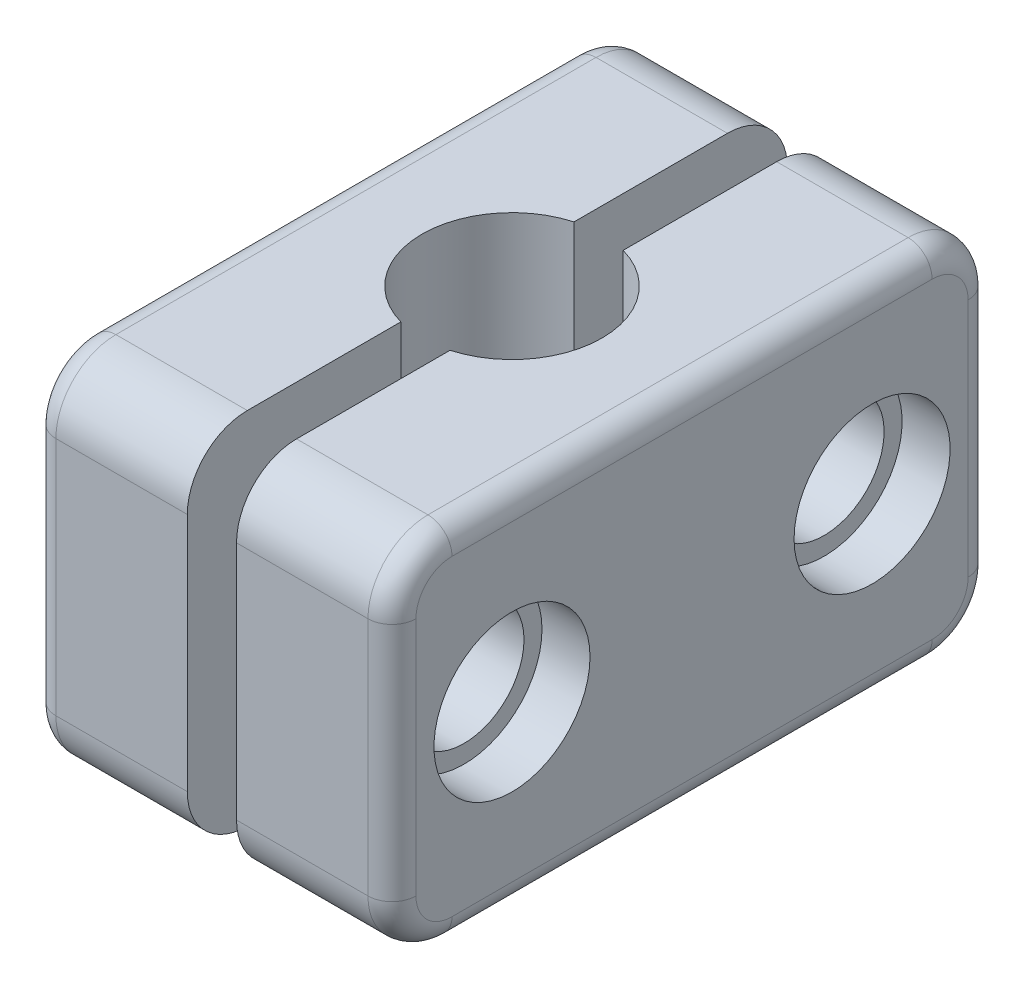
ISO-10303-21;
HEADER;
FILE_DESCRIPTION(('STEP AP214'),'2;1');
FILE_NAME('part.step','',(''),(''),'','','');
FILE_SCHEMA(('AUTOMOTIVE_DESIGN { 1 0 10303 214 1 1 1 1 }'));
ENDSEC;
DATA;
#1=APPLICATION_CONTEXT('core data for automotive mechanical design processes');
#2=APPLICATION_PROTOCOL_DEFINITION('international standard','automotive_design',2000,#1);
#3=PRODUCT_CONTEXT('',#1,'mechanical');
#4=PRODUCT('Part','Part','',(#3));
#5=PRODUCT_RELATED_PRODUCT_CATEGORY('part','',(#4));
#6=PRODUCT_DEFINITION_FORMATION('','',#4);
#7=PRODUCT_DEFINITION_CONTEXT('part definition',#1,'design');
#8=PRODUCT_DEFINITION('design','',#6,#7);
#9=PRODUCT_DEFINITION_SHAPE('','',#8);
#10=(LENGTH_UNIT() NAMED_UNIT(*) SI_UNIT(.MILLI.,.METRE.));
#11=(NAMED_UNIT(*) PLANE_ANGLE_UNIT() SI_UNIT($,.RADIAN.));
#12=(NAMED_UNIT(*) SI_UNIT($,.STERADIAN.) SOLID_ANGLE_UNIT());
#13=UNCERTAINTY_MEASURE_WITH_UNIT(LENGTH_MEASURE(1.E-05),#10,'distance_accuracy_value','');
#14=(GEOMETRIC_REPRESENTATION_CONTEXT(3) GLOBAL_UNCERTAINTY_ASSIGNED_CONTEXT((#13)) GLOBAL_UNIT_ASSIGNED_CONTEXT((#10,
#11,#12)) REPRESENTATION_CONTEXT('',''));
#15=CARTESIAN_POINT('',(0.,0.,0.));
#16=DIRECTION('',(0.,0.,1.));
#17=DIRECTION('',(1.,0.,0.));
#18=AXIS2_PLACEMENT_3D('',#15,#16,#17);
#19=CARTESIAN_POINT('',(-11.,0.,15.));
#20=DIRECTION('',(-1.,0.,0.));
#21=DIRECTION('',(0.,0.,-1.));
#22=AXIS2_PLACEMENT_3D('',#19,#20,#21);
#23=CYLINDRICAL_SURFACE('',#22,6.5);
#24=CARTESIAN_POINT('',(-11.,0.,15.));
#25=DIRECTION('',(-1.,0.,0.));
#26=DIRECTION('',(0.,0.,-1.));
#27=AXIS2_PLACEMENT_3D('',#24,#25,#26);
#28=CIRCLE('',#27,6.5);
#29=CARTESIAN_POINT('',(-11.,0.,8.5));
#30=VERTEX_POINT('',#29);
#31=EDGE_CURVE('E201',#30,#30,#28,.T.);
#32=ORIENTED_EDGE('',*,*,#31,.F.);
#33=EDGE_LOOP('',(#32));
#34=FACE_BOUND('',#33,.T.);
#35=CARTESIAN_POINT('',(-15.,0.,15.));
#36=DIRECTION('',(-1.,0.,0.));
#37=DIRECTION('',(0.,0.,-1.));
#38=AXIS2_PLACEMENT_3D('',#35,#36,#37);
#39=CIRCLE('',#38,6.5);
#40=CARTESIAN_POINT('',(-15.,0.,8.5));
#41=VERTEX_POINT('',#40);
#42=EDGE_CURVE('E193',#41,#41,#39,.T.);
#43=ORIENTED_EDGE('',*,*,#42,.T.);
#44=EDGE_LOOP('',(#43));
#45=FACE_BOUND('',#44,.T.);
#46=ADVANCED_FACE('F47',(#34,#45),#23,.F.);
#47=CARTESIAN_POINT('',(-11.,0.,15.));
#48=DIRECTION('',(1.,0.,0.));
#49=DIRECTION('',(0.,0.,-1.));
#50=AXIS2_PLACEMENT_3D('',#47,#48,#49);
#51=PLANE('',#50);
#52=CARTESIAN_POINT('',(-11.,0.,15.));
#53=DIRECTION('',(-1.,0.,0.));
#54=DIRECTION('',(0.,0.,1.));
#55=AXIS2_PLACEMENT_3D('',#52,#53,#54);
#56=CIRCLE('',#55,5.);
#57=CARTESIAN_POINT('',(-11.,0.,20.));
#58=VERTEX_POINT('',#57);
#59=EDGE_CURVE('E197',#58,#58,#56,.T.);
#60=ORIENTED_EDGE('',*,*,#59,.F.);
#61=EDGE_LOOP('',(#60));
#62=FACE_BOUND('',#61,.T.);
#63=ORIENTED_EDGE('',*,*,#31,.T.);
#64=EDGE_LOOP('',(#63));
#65=FACE_BOUND('',#64,.T.);
#66=ADVANCED_FACE('F358',(#62,#65),#51,.F.);
#67=CARTESIAN_POINT('',(15.,0.,15.));
#68=DIRECTION('',(-1.,0.,0.));
#69=DIRECTION('',(0.,0.,-1.));
#70=AXIS2_PLACEMENT_3D('',#67,#68,#69);
#71=CYLINDRICAL_SURFACE('',#70,5.);
#72=CARTESIAN_POINT('',(-2.05,0.,15.));
#73=DIRECTION('',(1.,0.,0.));
#74=DIRECTION('',(0.,0.,-1.));
#75=AXIS2_PLACEMENT_3D('',#72,#73,#74);
#76=CIRCLE('',#75,5.);
#77=CARTESIAN_POINT('',(-2.05,0.,10.));
#78=VERTEX_POINT('',#77);
#79=EDGE_CURVE('E173',#78,#78,#76,.T.);
#80=ORIENTED_EDGE('',*,*,#79,.T.);
#81=EDGE_LOOP('',(#80));
#82=FACE_BOUND('',#81,.T.);
#83=ORIENTED_EDGE('',*,*,#59,.T.);
#84=EDGE_LOOP('',(#83));
#85=FACE_BOUND('',#84,.T.);
#86=ADVANCED_FACE('F364',(#82,#85),#71,.F.);
#87=CARTESIAN_POINT('',(-15.,10.,20.));
#88=DIRECTION('',(-1.,0.,0.));
#89=DIRECTION('',(0.,0.,-1.));
#90=AXIS2_PLACEMENT_3D('',#87,#88,#89);
#91=PLANE('',#90);
#92=CARTESIAN_POINT('',(-15.,0.,-15.));
#93=DIRECTION('',(-1.,0.,0.));
#94=DIRECTION('',(0.,0.,1.));
#95=AXIS2_PLACEMENT_3D('',#92,#93,#94);
#96=CIRCLE('',#95,6.5);
#97=CARTESIAN_POINT('',(-15.,0.,-8.5));
#98=VERTEX_POINT('',#97);
#99=EDGE_CURVE('E198',#98,#98,#96,.T.);
#100=ORIENTED_EDGE('',*,*,#99,.F.);
#101=EDGE_LOOP('',(#100));
#102=FACE_BOUND('',#101,.T.);
#103=ORIENTED_EDGE('',*,*,#42,.F.);
#104=EDGE_LOOP('',(#103));
#105=FACE_BOUND('',#104,.T.);
#106=DIRECTION('',(0.,0.,-1.));
#107=VECTOR('',#106,1.);
#108=CARTESIAN_POINT('',(-15.,13.,20.));
#109=LINE('',#108,#107);
#110=CARTESIAN_POINT('',(-15.,13.,-20.));
#111=VERTEX_POINT('',#110);
#112=CARTESIAN_POINT('',(-15.,13.,20.));
#113=VERTEX_POINT('',#112);
#114=EDGE_CURVE('E224',#111,#113,#109,.F.);
#115=ORIENTED_EDGE('',*,*,#114,.F.);
#116=CARTESIAN_POINT('',(-15.,10.,-20.));
#117=DIRECTION('',(1.,0.,0.));
#118=DIRECTION('',(0.,0.,-1.));
#119=AXIS2_PLACEMENT_3D('',#116,#117,#118);
#120=CIRCLE('',#119,3.);
#121=CARTESIAN_POINT('',(-15.,9.99999999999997,-23.));
#122=VERTEX_POINT('',#121);
#123=EDGE_CURVE('E227',#122,#111,#120,.T.);
#124=ORIENTED_EDGE('',*,*,#123,.F.);
#125=DIRECTION('',(0.,-1.,0.));
#126=VECTOR('',#125,1.);
#127=CARTESIAN_POINT('',(-15.,9.99999999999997,-23.));
#128=LINE('',#127,#126);
#129=CARTESIAN_POINT('',(-15.,-9.99999999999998,-23.));
#130=VERTEX_POINT('',#129);
#131=EDGE_CURVE('E230',#130,#122,#128,.F.);
#132=ORIENTED_EDGE('',*,*,#131,.F.);
#133=CARTESIAN_POINT('',(-15.,-10.,-20.));
#134=DIRECTION('',(1.,0.,0.));
#135=DIRECTION('',(0.,0.,-1.));
#136=AXIS2_PLACEMENT_3D('',#133,#134,#135);
#137=CIRCLE('',#136,3.);
#138=CARTESIAN_POINT('',(-15.,-13.,-20.));
#139=VERTEX_POINT('',#138);
#140=EDGE_CURVE('E233',#139,#130,#137,.T.);
#141=ORIENTED_EDGE('',*,*,#140,.F.);
#142=DIRECTION('',(0.,0.,1.));
#143=VECTOR('',#142,1.);
#144=CARTESIAN_POINT('',(-15.,-13.,-20.));
#145=LINE('',#144,#143);
#146=CARTESIAN_POINT('',(-15.,-13.,20.));
#147=VERTEX_POINT('',#146);
#148=EDGE_CURVE('E236',#147,#139,#145,.F.);
#149=ORIENTED_EDGE('',*,*,#148,.F.);
#150=CARTESIAN_POINT('',(-15.,-10.,20.));
#151=DIRECTION('',(1.,0.,0.));
#152=DIRECTION('',(0.,0.,-1.));
#153=AXIS2_PLACEMENT_3D('',#150,#151,#152);
#154=CIRCLE('',#153,3.);
#155=CARTESIAN_POINT('',(-15.,-10.,23.));
#156=VERTEX_POINT('',#155);
#157=EDGE_CURVE('E239',#156,#147,#154,.T.);
#158=ORIENTED_EDGE('',*,*,#157,.F.);
#159=DIRECTION('',(0.,1.,0.));
#160=VECTOR('',#159,1.);
#161=CARTESIAN_POINT('',(-15.,-10.,23.));
#162=LINE('',#161,#160);
#163=CARTESIAN_POINT('',(-15.,9.99999999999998,23.));
#164=VERTEX_POINT('',#163);
#165=EDGE_CURVE('E242',#164,#156,#162,.F.);
#166=ORIENTED_EDGE('',*,*,#165,.F.);
#167=CARTESIAN_POINT('',(-15.,10.,20.));
#168=DIRECTION('',(1.,0.,0.));
#169=DIRECTION('',(0.,0.,-1.));
#170=AXIS2_PLACEMENT_3D('',#167,#168,#169);
#171=CIRCLE('',#170,3.);
#172=EDGE_CURVE('E245',#113,#164,#171,.T.);
#173=ORIENTED_EDGE('',*,*,#172,.F.);
#174=EDGE_LOOP('',(#115,#124,#132,#141,#149,#158,#166,#173));
#175=FACE_BOUND('',#174,.T.);
#176=ADVANCED_FACE('F315',(#102,#105,#175),#91,.T.);
#177=CARTESIAN_POINT('',(-13.,10.,20.));
#178=DIRECTION('',(-1.,0.,0.));
#179=DIRECTION('',(0.,0.,-1.));
#180=AXIS2_PLACEMENT_3D('',#177,#178,#179);
#181=TOROIDAL_SURFACE('',#180,3.,2.);
#182=CARTESIAN_POINT('',(-13.,9.99999999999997,23.));
#183=DIRECTION('',(0.,-1.,0.));
#184=DIRECTION('',(-1.,0.,0.));
#185=AXIS2_PLACEMENT_3D('',#182,#183,#184);
#186=CIRCLE('',#185,2.);
#187=CARTESIAN_POINT('',(-13.,9.99999999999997,25.));
#188=VERTEX_POINT('',#187);
#189=EDGE_CURVE('E272',#188,#164,#186,.T.);
#190=ORIENTED_EDGE('',*,*,#189,.F.);
#191=CARTESIAN_POINT('',(-13.,10.,20.));
#192=DIRECTION('',(1.,0.,0.));
#193=DIRECTION('',(0.,0.,-1.));
#194=AXIS2_PLACEMENT_3D('',#191,#192,#193);
#195=CIRCLE('',#194,5.);
#196=CARTESIAN_POINT('',(-13.,15.,20.));
#197=VERTEX_POINT('',#196);
#198=EDGE_CURVE('E221',#188,#197,#195,.F.);
#199=ORIENTED_EDGE('',*,*,#198,.T.);
#200=CARTESIAN_POINT('',(-13.,13.,20.));
#201=DIRECTION('',(0.,0.,-1.));
#202=DIRECTION('',(0.,1.,0.));
#203=AXIS2_PLACEMENT_3D('',#200,#201,#202);
#204=CIRCLE('',#203,2.);
#205=EDGE_CURVE('E269',#113,#197,#204,.T.);
#206=ORIENTED_EDGE('',*,*,#205,.F.);
#207=ORIENTED_EDGE('',*,*,#172,.T.);
#208=EDGE_LOOP('',(#190,#199,#206,#207));
#209=FACE_BOUND('',#208,.T.);
#210=ADVANCED_FACE('F320',(#209),#181,.T.);
#211=CARTESIAN_POINT('',(-13.,13.,-20.));
#212=DIRECTION('',(0.,0.,1.));
#213=DIRECTION('',(-1.,0.,0.));
#214=AXIS2_PLACEMENT_3D('',#211,#212,#213);
#215=CYLINDRICAL_SURFACE('',#214,2.);
#216=CARTESIAN_POINT('',(-13.,13.,-20.));
#217=DIRECTION('',(0.,0.,-1.));
#218=DIRECTION('',(0.,1.,0.));
#219=AXIS2_PLACEMENT_3D('',#216,#217,#218);
#220=CIRCLE('',#219,2.);
#221=CARTESIAN_POINT('',(-13.,15.,-20.));
#222=VERTEX_POINT('',#221);
#223=EDGE_CURVE('E275',#111,#222,#220,.T.);
#224=ORIENTED_EDGE('',*,*,#223,.F.);
#225=ORIENTED_EDGE('',*,*,#114,.T.);
#226=ORIENTED_EDGE('',*,*,#205,.T.);
#227=DIRECTION('',(0.,0.,-1.));
#228=VECTOR('',#227,1.);
#229=CARTESIAN_POINT('',(-13.,15.,-20.));
#230=LINE('',#229,#228);
#231=EDGE_CURVE('E266',#197,#222,#230,.T.);
#232=ORIENTED_EDGE('',*,*,#231,.T.);
#233=EDGE_LOOP('',(#224,#225,#226,#232));
#234=FACE_BOUND('',#233,.T.);
#235=ADVANCED_FACE('F308',(#234),#215,.T.);
#236=CARTESIAN_POINT('',(-13.,10.,-20.));
#237=DIRECTION('',(-1.,0.,0.));
#238=DIRECTION('',(0.,0.,-1.));
#239=AXIS2_PLACEMENT_3D('',#236,#237,#238);
#240=TOROIDAL_SURFACE('',#239,3.,2.);
#241=CARTESIAN_POINT('',(-13.,9.99999999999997,-23.));
#242=DIRECTION('',(0.,-1.,0.));
#243=DIRECTION('',(0.,0.,-1.));
#244=AXIS2_PLACEMENT_3D('',#241,#242,#243);
#245=CIRCLE('',#244,2.);
#246=CARTESIAN_POINT('',(-13.,9.99999999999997,-25.));
#247=VERTEX_POINT('',#246);
#248=EDGE_CURVE('E280',#122,#247,#245,.T.);
#249=ORIENTED_EDGE('',*,*,#248,.F.);
#250=ORIENTED_EDGE('',*,*,#123,.T.);
#251=ORIENTED_EDGE('',*,*,#223,.T.);
#252=CARTESIAN_POINT('',(-13.,10.,-20.));
#253=DIRECTION('',(1.,0.,0.));
#254=DIRECTION('',(0.,0.,-1.));
#255=AXIS2_PLACEMENT_3D('',#252,#253,#254);
#256=CIRCLE('',#255,5.);
#257=EDGE_CURVE('E263',#222,#247,#256,.F.);
#258=ORIENTED_EDGE('',*,*,#257,.T.);
#259=EDGE_LOOP('',(#249,#250,#251,#258));
#260=FACE_BOUND('',#259,.T.);
#261=ADVANCED_FACE('F309',(#260),#240,.T.);
#262=CARTESIAN_POINT('',(-13.,9.99999999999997,-23.));
#263=DIRECTION('',(0.,1.,0.));
#264=DIRECTION('',(0.,0.,-1.));
#265=AXIS2_PLACEMENT_3D('',#262,#263,#264);
#266=CYLINDRICAL_SURFACE('',#265,2.);
#267=CARTESIAN_POINT('',(-13.,-9.99999999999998,-23.));
#268=DIRECTION('',(0.,-1.,0.));
#269=DIRECTION('',(0.,0.,-1.));
#270=AXIS2_PLACEMENT_3D('',#267,#268,#269);
#271=CIRCLE('',#270,2.);
#272=CARTESIAN_POINT('',(-13.,-9.99999999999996,-25.));
#273=VERTEX_POINT('',#272);
#274=EDGE_CURVE('E285',#130,#273,#271,.T.);
#275=ORIENTED_EDGE('',*,*,#274,.F.);
#276=ORIENTED_EDGE('',*,*,#131,.T.);
#277=ORIENTED_EDGE('',*,*,#248,.T.);
#278=DIRECTION('',(0.,-1.,0.));
#279=VECTOR('',#278,1.);
#280=CARTESIAN_POINT('',(-13.,-9.99999999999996,-25.));
#281=LINE('',#280,#279);
#282=EDGE_CURVE('E260',#247,#273,#281,.T.);
#283=ORIENTED_EDGE('',*,*,#282,.T.);
#284=EDGE_LOOP('',(#275,#276,#277,#283));
#285=FACE_BOUND('',#284,.T.);
#286=ADVANCED_FACE('F346',(#285),#266,.T.);
#287=CARTESIAN_POINT('',(-13.,-10.,-20.));
#288=DIRECTION('',(-1.,0.,0.));
#289=DIRECTION('',(0.,0.,-1.));
#290=AXIS2_PLACEMENT_3D('',#287,#288,#289);
#291=TOROIDAL_SURFACE('',#290,3.,2.);
#292=ORIENTED_EDGE('',*,*,#274,.T.);
#293=CARTESIAN_POINT('',(-13.,-10.,-20.));
#294=DIRECTION('',(1.,0.,0.));
#295=DIRECTION('',(0.,0.,-1.));
#296=AXIS2_PLACEMENT_3D('',#293,#294,#295);
#297=CIRCLE('',#296,5.);
#298=CARTESIAN_POINT('',(-13.,-15.,-20.));
#299=VERTEX_POINT('',#298);
#300=EDGE_CURVE('E257',#273,#299,#297,.F.);
#301=ORIENTED_EDGE('',*,*,#300,.T.);
#302=CARTESIAN_POINT('',(-13.,-13.,-20.));
#303=DIRECTION('',(0.,0.,-1.));
#304=DIRECTION('',(0.,1.,0.));
#305=AXIS2_PLACEMENT_3D('',#302,#303,#304);
#306=CIRCLE('',#305,2.);
#307=EDGE_CURVE('E209',#299,#139,#306,.T.);
#308=ORIENTED_EDGE('',*,*,#307,.T.);
#309=ORIENTED_EDGE('',*,*,#140,.T.);
#310=EDGE_LOOP('',(#292,#301,#308,#309));
#311=FACE_BOUND('',#310,.T.);
#312=ADVANCED_FACE('F49',(#311),#291,.T.);
#313=CARTESIAN_POINT('',(-13.,-13.,-20.));
#314=DIRECTION('',(0.,0.,-1.));
#315=DIRECTION('',(1.,0.,0.));
#316=AXIS2_PLACEMENT_3D('',#313,#314,#315);
#317=CYLINDRICAL_SURFACE('',#316,2.);
#318=ORIENTED_EDGE('',*,*,#307,.F.);
#319=DIRECTION('',(0.,0.,1.));
#320=VECTOR('',#319,1.);
#321=CARTESIAN_POINT('',(-13.,-15.,20.));
#322=LINE('',#321,#320);
#323=CARTESIAN_POINT('',(-13.,-15.,20.));
#324=VERTEX_POINT('',#323);
#325=EDGE_CURVE('E254',#299,#324,#322,.T.);
#326=ORIENTED_EDGE('',*,*,#325,.T.);
#327=CARTESIAN_POINT('',(-13.,-13.,20.));
#328=DIRECTION('',(0.,0.,-1.));
#329=DIRECTION('',(-1.,0.,0.));
#330=AXIS2_PLACEMENT_3D('',#327,#328,#329);
#331=CIRCLE('',#330,2.);
#332=EDGE_CURVE('E283',#324,#147,#331,.T.);
#333=ORIENTED_EDGE('',*,*,#332,.T.);
#334=ORIENTED_EDGE('',*,*,#148,.T.);
#335=EDGE_LOOP('',(#318,#326,#333,#334));
#336=FACE_BOUND('',#335,.T.);
#337=ADVANCED_FACE('F339',(#336),#317,.T.);
#338=CARTESIAN_POINT('',(-13.,-10.,20.));
#339=DIRECTION('',(-1.,0.,0.));
#340=DIRECTION('',(0.,0.,-1.));
#341=AXIS2_PLACEMENT_3D('',#338,#339,#340);
#342=TOROIDAL_SURFACE('',#341,3.,2.);
#343=ORIENTED_EDGE('',*,*,#332,.F.);
#344=CARTESIAN_POINT('',(-13.,-10.,20.));
#345=DIRECTION('',(1.,0.,0.));
#346=DIRECTION('',(0.,0.,-1.));
#347=AXIS2_PLACEMENT_3D('',#344,#345,#346);
#348=CIRCLE('',#347,5.);
#349=CARTESIAN_POINT('',(-13.,-10.,25.));
#350=VERTEX_POINT('',#349);
#351=EDGE_CURVE('E251',#324,#350,#348,.F.);
#352=ORIENTED_EDGE('',*,*,#351,.T.);
#353=CARTESIAN_POINT('',(-13.,-10.,23.));
#354=DIRECTION('',(0.,-1.,0.));
#355=DIRECTION('',(0.,0.,-1.));
#356=AXIS2_PLACEMENT_3D('',#353,#354,#355);
#357=CIRCLE('',#356,2.);
#358=EDGE_CURVE('E278',#350,#156,#357,.T.);
#359=ORIENTED_EDGE('',*,*,#358,.T.);
#360=ORIENTED_EDGE('',*,*,#157,.T.);
#361=EDGE_LOOP('',(#343,#352,#359,#360));
#362=FACE_BOUND('',#361,.T.);
#363=ADVANCED_FACE('F335',(#362),#342,.T.);
#364=CARTESIAN_POINT('',(-13.,9.99999999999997,23.));
#365=DIRECTION('',(0.,-1.,0.));
#366=DIRECTION('',(0.,0.,1.));
#367=AXIS2_PLACEMENT_3D('',#364,#365,#366);
#368=CYLINDRICAL_SURFACE('',#367,2.);
#369=ORIENTED_EDGE('',*,*,#358,.F.);
#370=DIRECTION('',(0.,1.,0.));
#371=VECTOR('',#370,1.);
#372=CARTESIAN_POINT('',(-13.,9.99999999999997,25.));
#373=LINE('',#372,#371);
#374=EDGE_CURVE('E248',#350,#188,#373,.T.);
#375=ORIENTED_EDGE('',*,*,#374,.T.);
#376=ORIENTED_EDGE('',*,*,#189,.T.);
#377=ORIENTED_EDGE('',*,*,#165,.T.);
#378=EDGE_LOOP('',(#369,#375,#376,#377));
#379=FACE_BOUND('',#378,.T.);
#380=ADVANCED_FACE('F384',(#379),#368,.T.);
#381=CARTESIAN_POINT('',(15.,9.99999999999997,25.));
#382=DIRECTION('',(0.,0.,-1.));
#383=DIRECTION('',(0.,-1.,0.));
#384=AXIS2_PLACEMENT_3D('',#381,#382,#383);
#385=PLANE('',#384);
#386=DIRECTION('',(-1.,0.,0.));
#387=VECTOR('',#386,1.);
#388=CARTESIAN_POINT('',(15.,9.99999999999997,25.));
#389=LINE('',#388,#387);
#390=CARTESIAN_POINT('',(-2.05,9.99999999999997,25.));
#391=VERTEX_POINT('',#390);
#392=EDGE_CURVE('E206',#391,#188,#389,.T.);
#393=ORIENTED_EDGE('',*,*,#392,.T.);
#394=ORIENTED_EDGE('',*,*,#374,.F.);
#395=DIRECTION('',(-1.,0.,0.));
#396=VECTOR('',#395,1.);
#397=CARTESIAN_POINT('',(15.,-10.,25.));
#398=LINE('',#397,#396);
#399=CARTESIAN_POINT('',(-2.05,-10.,25.));
#400=VERTEX_POINT('',#399);
#401=EDGE_CURVE('E208',#400,#350,#398,.T.);
#402=ORIENTED_EDGE('',*,*,#401,.F.);
#403=DIRECTION('',(0.,-1.,0.));
#404=VECTOR('',#403,1.);
#405=CARTESIAN_POINT('',(-2.05,9.99999999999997,25.));
#406=LINE('',#405,#404);
#407=EDGE_CURVE('E175',#391,#400,#406,.T.);
#408=ORIENTED_EDGE('',*,*,#407,.F.);
#409=EDGE_LOOP('',(#393,#394,#402,#408));
#410=FACE_BOUND('',#409,.T.);
#411=ADVANCED_FACE('F328',(#410),#385,.F.);
#412=CARTESIAN_POINT('',(15.,-10.,20.));
#413=DIRECTION('',(-1.,0.,0.));
#414=DIRECTION('',(0.,0.,-1.));
#415=AXIS2_PLACEMENT_3D('',#412,#413,#414);
#416=CYLINDRICAL_SURFACE('',#415,5.);
#417=ORIENTED_EDGE('',*,*,#401,.T.);
#418=ORIENTED_EDGE('',*,*,#351,.F.);
#419=DIRECTION('',(-1.,0.,0.));
#420=VECTOR('',#419,1.);
#421=CARTESIAN_POINT('',(15.,-15.,20.));
#422=LINE('',#421,#420);
#423=CARTESIAN_POINT('',(-2.05,-15.,20.));
#424=VERTEX_POINT('',#423);
#425=EDGE_CURVE('E211',#424,#324,#422,.T.);
#426=ORIENTED_EDGE('',*,*,#425,.F.);
#427=CARTESIAN_POINT('',(-2.05,-10.,20.));
#428=DIRECTION('',(1.,0.,0.));
#429=DIRECTION('',(0.,0.,-1.));
#430=AXIS2_PLACEMENT_3D('',#427,#428,#429);
#431=CIRCLE('',#430,5.);
#432=EDGE_CURVE('E62',#400,#424,#431,.T.);
#433=ORIENTED_EDGE('',*,*,#432,.F.);
#434=EDGE_LOOP('',(#417,#418,#426,#433));
#435=FACE_BOUND('',#434,.T.);
#436=ADVANCED_FACE('F332',(#435),#416,.T.);
#437=CARTESIAN_POINT('',(15.,-15.,-20.));
#438=DIRECTION('',(0.,1.,0.));
#439=DIRECTION('',(0.,0.,-1.));
#440=AXIS2_PLACEMENT_3D('',#437,#438,#439);
#441=PLANE('',#440);
#442=CARTESIAN_POINT('',(0.,-15.,0.));
#443=DIRECTION('',(0.,-1.,0.));
#444=DIRECTION('',(0.,0.,-1.));
#445=AXIS2_PLACEMENT_3D('',#442,#443,#444);
#446=CIRCLE('',#445,7.5);
#447=CARTESIAN_POINT('',(-2.05,-15.,7.21439533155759));
#448=VERTEX_POINT('',#447);
#449=CARTESIAN_POINT('',(-2.05,-15.,-7.21439533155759));
#450=VERTEX_POINT('',#449);
#451=EDGE_CURVE('E55',#448,#450,#446,.T.);
#452=ORIENTED_EDGE('',*,*,#451,.F.);
#453=DIRECTION('',(0.,0.,-1.));
#454=VECTOR('',#453,1.);
#455=CARTESIAN_POINT('',(-2.04999999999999,-15.,-20.));
#456=LINE('',#455,#454);
#457=EDGE_CURVE('E156',#424,#448,#456,.T.);
#458=ORIENTED_EDGE('',*,*,#457,.F.);
#459=ORIENTED_EDGE('',*,*,#425,.T.);
#460=ORIENTED_EDGE('',*,*,#325,.F.);
#461=DIRECTION('',(-1.,0.,0.));
#462=VECTOR('',#461,1.);
#463=CARTESIAN_POINT('',(15.,-15.,-20.));
#464=LINE('',#463,#462);
#465=CARTESIAN_POINT('',(-2.05,-15.,-20.));
#466=VERTEX_POINT('',#465);
#467=EDGE_CURVE('E213',#466,#299,#464,.T.);
#468=ORIENTED_EDGE('',*,*,#467,.F.);
#469=DIRECTION('',(0.,0.,-1.));
#470=VECTOR('',#469,1.);
#471=CARTESIAN_POINT('',(-2.05,-15.,-20.));
#472=LINE('',#471,#470);
#473=EDGE_CURVE('E12',#450,#466,#472,.T.);
#474=ORIENTED_EDGE('',*,*,#473,.F.);
#475=EDGE_LOOP('',(#452,#458,#459,#460,#468,#474));
#476=FACE_BOUND('',#475,.T.);
#477=ADVANCED_FACE('F296',(#476),#441,.F.);
#478=CARTESIAN_POINT('',(15.,-10.,-20.));
#479=DIRECTION('',(-1.,0.,0.));
#480=DIRECTION('',(0.,0.,-1.));
#481=AXIS2_PLACEMENT_3D('',#478,#479,#480);
#482=CYLINDRICAL_SURFACE('',#481,5.);
#483=ORIENTED_EDGE('',*,*,#467,.T.);
#484=ORIENTED_EDGE('',*,*,#300,.F.);
#485=DIRECTION('',(-1.,0.,0.));
#486=VECTOR('',#485,1.);
#487=CARTESIAN_POINT('',(15.,-9.99999999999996,-25.));
#488=LINE('',#487,#486);
#489=CARTESIAN_POINT('',(-2.05,-10.,-25.));
#490=VERTEX_POINT('',#489);
#491=EDGE_CURVE('E215',#490,#273,#488,.T.);
#492=ORIENTED_EDGE('',*,*,#491,.F.);
#493=CARTESIAN_POINT('',(-2.05,-10.,-20.));
#494=DIRECTION('',(1.,0.,0.));
#495=DIRECTION('',(0.,0.,-1.));
#496=AXIS2_PLACEMENT_3D('',#493,#494,#495);
#497=CIRCLE('',#496,5.);
#498=EDGE_CURVE('E181',#466,#490,#497,.T.);
#499=ORIENTED_EDGE('',*,*,#498,.F.);
#500=EDGE_LOOP('',(#483,#484,#492,#499));
#501=FACE_BOUND('',#500,.T.);
#502=ADVANCED_FACE('F344',(#501),#482,.T.);
#503=CARTESIAN_POINT('',(15.,9.99999999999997,-25.));
#504=DIRECTION('',(0.,0.,1.));
#505=DIRECTION('',(0.,1.,0.));
#506=AXIS2_PLACEMENT_3D('',#503,#504,#505);
#507=PLANE('',#506);
#508=ORIENTED_EDGE('',*,*,#491,.T.);
#509=ORIENTED_EDGE('',*,*,#282,.F.);
#510=DIRECTION('',(-1.,0.,0.));
#511=VECTOR('',#510,1.);
#512=CARTESIAN_POINT('',(15.,9.99999999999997,-25.));
#513=LINE('',#512,#511);
#514=CARTESIAN_POINT('',(-2.05,9.99999999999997,-25.));
#515=VERTEX_POINT('',#514);
#516=EDGE_CURVE('E217',#515,#247,#513,.T.);
#517=ORIENTED_EDGE('',*,*,#516,.F.);
#518=DIRECTION('',(0.,1.,0.));
#519=VECTOR('',#518,1.);
#520=CARTESIAN_POINT('',(-2.05,9.99999999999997,-25.));
#521=LINE('',#520,#519);
#522=EDGE_CURVE('E184',#490,#515,#521,.T.);
#523=ORIENTED_EDGE('',*,*,#522,.F.);
#524=EDGE_LOOP('',(#508,#509,#517,#523));
#525=FACE_BOUND('',#524,.T.);
#526=ADVANCED_FACE('F348',(#525),#507,.F.);
#527=CARTESIAN_POINT('',(15.,10.,-20.));
#528=DIRECTION('',(-1.,0.,0.));
#529=DIRECTION('',(0.,0.,-1.));
#530=AXIS2_PLACEMENT_3D('',#527,#528,#529);
#531=CYLINDRICAL_SURFACE('',#530,5.);
#532=ORIENTED_EDGE('',*,*,#516,.T.);
#533=ORIENTED_EDGE('',*,*,#257,.F.);
#534=DIRECTION('',(-1.,0.,0.));
#535=VECTOR('',#534,1.);
#536=CARTESIAN_POINT('',(15.,15.,-20.));
#537=LINE('',#536,#535);
#538=CARTESIAN_POINT('',(-2.05,15.,-20.));
#539=VERTEX_POINT('',#538);
#540=EDGE_CURVE('E70',#539,#222,#537,.T.);
#541=ORIENTED_EDGE('',*,*,#540,.F.);
#542=CARTESIAN_POINT('',(-2.05,10.,-20.));
#543=DIRECTION('',(1.,0.,0.));
#544=DIRECTION('',(0.,0.,-1.));
#545=AXIS2_PLACEMENT_3D('',#542,#543,#544);
#546=CIRCLE('',#545,5.);
#547=EDGE_CURVE('E187',#515,#539,#546,.T.);
#548=ORIENTED_EDGE('',*,*,#547,.F.);
#549=EDGE_LOOP('',(#532,#533,#541,#548));
#550=FACE_BOUND('',#549,.T.);
#551=ADVANCED_FACE('F304',(#550),#531,.T.);
#552=CARTESIAN_POINT('',(15.,15.,-20.));
#553=DIRECTION('',(0.,-1.,0.));
#554=DIRECTION('',(0.,0.,1.));
#555=AXIS2_PLACEMENT_3D('',#552,#553,#554);
#556=PLANE('',#555);
#557=ORIENTED_EDGE('',*,*,#540,.T.);
#558=ORIENTED_EDGE('',*,*,#231,.F.);
#559=DIRECTION('',(-1.,0.,0.));
#560=VECTOR('',#559,1.);
#561=CARTESIAN_POINT('',(15.,15.,20.));
#562=LINE('',#561,#560);
#563=CARTESIAN_POINT('',(-2.05,15.,20.));
#564=VERTEX_POINT('',#563);
#565=EDGE_CURVE('E169',#564,#197,#562,.T.);
#566=ORIENTED_EDGE('',*,*,#565,.F.);
#567=DIRECTION('',(0.,0.,-1.));
#568=VECTOR('',#567,1.);
#569=CARTESIAN_POINT('',(-2.05,15.,38.0518627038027));
#570=LINE('',#569,#568);
#571=CARTESIAN_POINT('',(-2.05,15.,7.21439533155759));
#572=VERTEX_POINT('',#571);
#573=EDGE_CURVE('E154',#564,#572,#570,.T.);
#574=ORIENTED_EDGE('',*,*,#573,.T.);
#575=CARTESIAN_POINT('',(0.,15.,0.));
#576=DIRECTION('',(0.,-1.,0.));
#577=DIRECTION('',(0.,0.,-1.));
#578=AXIS2_PLACEMENT_3D('',#575,#576,#577);
#579=CIRCLE('',#578,7.5);
#580=CARTESIAN_POINT('',(-2.05,15.,-7.21439533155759));
#581=VERTEX_POINT('',#580);
#582=EDGE_CURVE('E164',#572,#581,#579,.T.);
#583=ORIENTED_EDGE('',*,*,#582,.T.);
#584=DIRECTION('',(0.,0.,-1.));
#585=VECTOR('',#584,1.);
#586=CARTESIAN_POINT('',(-2.05,15.,-7.21439533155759));
#587=LINE('',#586,#585);
#588=EDGE_CURVE('E161',#581,#539,#587,.T.);
#589=ORIENTED_EDGE('',*,*,#588,.T.);
#590=EDGE_LOOP('',(#557,#558,#566,#574,#583,#589));
#591=FACE_BOUND('',#590,.T.);
#592=ADVANCED_FACE('F168',(#591),#556,.F.);
#593=CARTESIAN_POINT('',(15.,10.,20.));
#594=DIRECTION('',(-1.,0.,0.));
#595=DIRECTION('',(0.,0.,-1.));
#596=AXIS2_PLACEMENT_3D('',#593,#594,#595);
#597=CYLINDRICAL_SURFACE('',#596,5.);
#598=ORIENTED_EDGE('',*,*,#565,.T.);
#599=ORIENTED_EDGE('',*,*,#198,.F.);
#600=ORIENTED_EDGE('',*,*,#392,.F.);
#601=CARTESIAN_POINT('',(-2.05,10.,20.));
#602=DIRECTION('',(1.,0.,0.));
#603=DIRECTION('',(0.,0.,-1.));
#604=AXIS2_PLACEMENT_3D('',#601,#602,#603);
#605=CIRCLE('',#604,5.);
#606=EDGE_CURVE('E179',#564,#391,#605,.T.);
#607=ORIENTED_EDGE('',*,*,#606,.F.);
#608=EDGE_LOOP('',(#598,#599,#600,#607));
#609=FACE_BOUND('',#608,.T.);
#610=ADVANCED_FACE('F324',(#609),#597,.T.);
#611=CARTESIAN_POINT('',(-11.,0.,-15.));
#612=DIRECTION('',(-1.,0.,0.));
#613=DIRECTION('',(0.,0.,-1.));
#614=AXIS2_PLACEMENT_3D('',#611,#612,#613);
#615=CYLINDRICAL_SURFACE('',#614,6.5);
#616=CARTESIAN_POINT('',(-11.,0.,-15.));
#617=DIRECTION('',(-1.,0.,0.));
#618=DIRECTION('',(0.,0.,1.));
#619=AXIS2_PLACEMENT_3D('',#616,#617,#618);
#620=CIRCLE('',#619,6.5);
#621=CARTESIAN_POINT('',(-11.,0.,-8.5));
#622=VERTEX_POINT('',#621);
#623=EDGE_CURVE('E194',#622,#622,#620,.T.);
#624=ORIENTED_EDGE('',*,*,#623,.F.);
#625=EDGE_LOOP('',(#624));
#626=FACE_BOUND('',#625,.T.);
#627=ORIENTED_EDGE('',*,*,#99,.T.);
#628=EDGE_LOOP('',(#627));
#629=FACE_BOUND('',#628,.T.);
#630=ADVANCED_FACE('F423',(#626,#629),#615,.F.);
#631=CARTESIAN_POINT('',(-11.,0.,-15.));
#632=DIRECTION('',(-1.,0.,0.));
#633=DIRECTION('',(0.,0.,1.));
#634=AXIS2_PLACEMENT_3D('',#631,#632,#633);
#635=PLANE('',#634);
#636=CARTESIAN_POINT('',(-11.,0.,-15.));
#637=DIRECTION('',(1.,0.,0.));
#638=DIRECTION('',(0.,0.,-1.));
#639=AXIS2_PLACEMENT_3D('',#636,#637,#638);
#640=CIRCLE('',#639,5.);
#641=CARTESIAN_POINT('',(-11.,0.,-20.));
#642=VERTEX_POINT('',#641);
#643=EDGE_CURVE('E273',#642,#642,#640,.T.);
#644=ORIENTED_EDGE('',*,*,#643,.T.);
#645=EDGE_LOOP('',(#644));
#646=FACE_BOUND('',#645,.T.);
#647=ORIENTED_EDGE('',*,*,#623,.T.);
#648=EDGE_LOOP('',(#647));
#649=FACE_BOUND('',#648,.T.);
#650=ADVANCED_FACE('F377',(#646,#649),#635,.T.);
#651=CARTESIAN_POINT('',(15.,0.,-15.));
#652=DIRECTION('',(-1.,0.,0.));
#653=DIRECTION('',(0.,0.,-1.));
#654=AXIS2_PLACEMENT_3D('',#651,#652,#653);
#655=CYLINDRICAL_SURFACE('',#654,5.);
#656=CARTESIAN_POINT('',(-2.05,0.,-15.));
#657=DIRECTION('',(1.,0.,0.));
#658=DIRECTION('',(0.,0.,-1.));
#659=AXIS2_PLACEMENT_3D('',#656,#657,#658);
#660=CIRCLE('',#659,5.);
#661=CARTESIAN_POINT('',(-2.05,0.,-20.));
#662=VERTEX_POINT('',#661);
#663=EDGE_CURVE('E190',#662,#662,#660,.T.);
#664=ORIENTED_EDGE('',*,*,#663,.T.);
#665=EDGE_LOOP('',(#664));
#666=FACE_BOUND('',#665,.T.);
#667=ORIENTED_EDGE('',*,*,#643,.F.);
#668=EDGE_LOOP('',(#667));
#669=FACE_BOUND('',#668,.T.);
#670=ADVANCED_FACE('F374',(#666,#669),#655,.F.);
#671=CARTESIAN_POINT('',(-2.05,-65.,-7.21439533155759));
#672=DIRECTION('',(-1.,0.,0.));
#673=DIRECTION('',(0.,0.,-1.));
#674=AXIS2_PLACEMENT_3D('',#671,#672,#673);
#675=PLANE('',#674);
#676=ORIENTED_EDGE('',*,*,#663,.F.);
#677=EDGE_LOOP('',(#676));
#678=FACE_BOUND('',#677,.T.);
#679=ORIENTED_EDGE('',*,*,#522,.T.);
#680=ORIENTED_EDGE('',*,*,#547,.T.);
#681=ORIENTED_EDGE('',*,*,#588,.F.);
#682=DIRECTION('',(0.,1.,0.));
#683=VECTOR('',#682,1.);
#684=CARTESIAN_POINT('',(-2.05,-65.,-7.21439533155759));
#685=LINE('',#684,#683);
#686=EDGE_CURVE('E160',#450,#581,#685,.T.);
#687=ORIENTED_EDGE('',*,*,#686,.F.);
#688=ORIENTED_EDGE('',*,*,#473,.T.);
#689=ORIENTED_EDGE('',*,*,#498,.T.);
#690=EDGE_LOOP('',(#679,#680,#681,#687,#688,#689));
#691=FACE_BOUND('',#690,.T.);
#692=ADVANCED_FACE('F300',(#678,#691),#675,.F.);
#693=CARTESIAN_POINT('',(0.,-65.,0.));
#694=DIRECTION('',(0.,1.,0.));
#695=DIRECTION('',(0.,0.,-1.));
#696=AXIS2_PLACEMENT_3D('',#693,#694,#695);
#697=CYLINDRICAL_SURFACE('',#696,7.5);
#698=DIRECTION('',(0.,1.,0.));
#699=VECTOR('',#698,1.);
#700=CARTESIAN_POINT('',(-2.05,-65.,7.21439533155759));
#701=LINE('',#700,#699);
#702=EDGE_CURVE('E150',#448,#572,#701,.T.);
#703=ORIENTED_EDGE('',*,*,#702,.F.);
#704=ORIENTED_EDGE('',*,*,#451,.T.);
#705=ORIENTED_EDGE('',*,*,#686,.T.);
#706=ORIENTED_EDGE('',*,*,#582,.F.);
#707=EDGE_LOOP('',(#703,#704,#705,#706));
#708=FACE_BOUND('',#707,.T.);
#709=ADVANCED_FACE('F165',(#708),#697,.F.);
#710=CARTESIAN_POINT('',(-2.05,-65.,38.0518627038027));
#711=DIRECTION('',(-1.,0.,0.));
#712=DIRECTION('',(0.,0.,-1.));
#713=AXIS2_PLACEMENT_3D('',#710,#711,#712);
#714=PLANE('',#713);
#715=ORIENTED_EDGE('',*,*,#79,.F.);
#716=EDGE_LOOP('',(#715));
#717=FACE_BOUND('',#716,.T.);
#718=ORIENTED_EDGE('',*,*,#573,.F.);
#719=ORIENTED_EDGE('',*,*,#606,.T.);
#720=ORIENTED_EDGE('',*,*,#407,.T.);
#721=ORIENTED_EDGE('',*,*,#432,.T.);
#722=ORIENTED_EDGE('',*,*,#457,.T.);
#723=ORIENTED_EDGE('',*,*,#702,.T.);
#724=EDGE_LOOP('',(#718,#719,#720,#721,#722,#723));
#725=FACE_BOUND('',#724,.T.);
#726=ADVANCED_FACE('F152',(#717,#725),#714,.F.);
#727=CLOSED_SHELL('',(#46,#66,#86,#176,#210,#235,#261,#286,#312,#337,#363,#380,#411,#436,#477,
#502,#526,#551,#592,#610,#630,#650,#670,#692,#709,#726));
#728=MANIFOLD_SOLID_BREP('B2',#727);
#729=CARTESIAN_POINT('',(15.,0.,-15.));
#730=DIRECTION('',(-1.,0.,0.));
#731=DIRECTION('',(0.,0.,-1.));
#732=AXIS2_PLACEMENT_3D('',#729,#730,#731);
#733=CYLINDRICAL_SURFACE('',#732,5.);
#734=CARTESIAN_POINT('',(2.05,0.,-15.));
#735=DIRECTION('',(-1.,0.,0.));
#736=DIRECTION('',(0.,0.,1.));
#737=AXIS2_PLACEMENT_3D('',#734,#735,#736);
#738=CIRCLE('',#737,5.);
#739=CARTESIAN_POINT('',(2.05,0.,-10.));
#740=VERTEX_POINT('',#739);
#741=EDGE_CURVE('E650',#740,#740,#738,.T.);
#742=ORIENTED_EDGE('',*,*,#741,.T.);
#743=EDGE_LOOP('',(#742));
#744=FACE_BOUND('',#743,.T.);
#745=CARTESIAN_POINT('',(11.,0.,-15.));
#746=DIRECTION('',(-1.,0.,0.));
#747=DIRECTION('',(0.,0.,1.));
#748=AXIS2_PLACEMENT_3D('',#745,#746,#747);
#749=CIRCLE('',#748,5.);
#750=CARTESIAN_POINT('',(11.,0.,-10.));
#751=VERTEX_POINT('',#750);
#752=EDGE_CURVE('E673',#751,#751,#749,.T.);
#753=ORIENTED_EDGE('',*,*,#752,.F.);
#754=EDGE_LOOP('',(#753));
#755=FACE_BOUND('',#754,.T.);
#756=ADVANCED_FACE('F589',(#744,#755),#733,.F.);
#757=CARTESIAN_POINT('',(15.,10.,-20.));
#758=DIRECTION('',(-1.,0.,0.));
#759=DIRECTION('',(0.,0.,-1.));
#760=AXIS2_PLACEMENT_3D('',#757,#758,#759);
#761=CYLINDRICAL_SURFACE('',#760,5.);
#762=DIRECTION('',(-1.,0.,0.));
#763=VECTOR('',#762,1.);
#764=CARTESIAN_POINT('',(15.,15.,-20.));
#765=LINE('',#764,#763);
#766=CARTESIAN_POINT('',(13.,15.,-20.));
#767=VERTEX_POINT('',#766);
#768=CARTESIAN_POINT('',(2.05,15.,-20.));
#769=VERTEX_POINT('',#768);
#770=EDGE_CURVE('E658',#767,#769,#765,.T.);
#771=ORIENTED_EDGE('',*,*,#770,.F.);
#772=CARTESIAN_POINT('',(13.,10.,-20.));
#773=DIRECTION('',(1.,0.,0.));
#774=DIRECTION('',(0.,0.,-1.));
#775=AXIS2_PLACEMENT_3D('',#772,#773,#774);
#776=CIRCLE('',#775,5.);
#777=CARTESIAN_POINT('',(13.,9.99999999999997,-25.));
#778=VERTEX_POINT('',#777);
#779=EDGE_CURVE('E678',#778,#767,#776,.T.);
#780=ORIENTED_EDGE('',*,*,#779,.F.);
#781=DIRECTION('',(-1.,0.,0.));
#782=VECTOR('',#781,1.);
#783=CARTESIAN_POINT('',(15.,9.99999999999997,-25.));
#784=LINE('',#783,#782);
#785=CARTESIAN_POINT('',(2.05,9.99999999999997,-25.));
#786=VERTEX_POINT('',#785);
#787=EDGE_CURVE('E674',#778,#786,#784,.T.);
#788=ORIENTED_EDGE('',*,*,#787,.T.);
#789=CARTESIAN_POINT('',(2.05,10.,-20.));
#790=DIRECTION('',(-1.,0.,0.));
#791=DIRECTION('',(0.,0.,1.));
#792=AXIS2_PLACEMENT_3D('',#789,#790,#791);
#793=CIRCLE('',#792,5.);
#794=EDGE_CURVE('E672',#769,#786,#793,.T.);
#795=ORIENTED_EDGE('',*,*,#794,.F.);
#796=EDGE_LOOP('',(#771,#780,#788,#795));
#797=FACE_BOUND('',#796,.T.);
#798=ADVANCED_FACE('F851',(#797),#761,.T.);
#799=CARTESIAN_POINT('',(15.,9.99999999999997,-25.));
#800=DIRECTION('',(0.,0.,1.));
#801=DIRECTION('',(0.,1.,0.));
#802=AXIS2_PLACEMENT_3D('',#799,#800,#801);
#803=PLANE('',#802);
#804=ORIENTED_EDGE('',*,*,#787,.F.);
#805=DIRECTION('',(0.,-1.,0.));
#806=VECTOR('',#805,1.);
#807=CARTESIAN_POINT('',(13.,9.99999999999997,-25.));
#808=LINE('',#807,#806);
#809=CARTESIAN_POINT('',(13.,-9.99999999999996,-25.));
#810=VERTEX_POINT('',#809);
#811=EDGE_CURVE('E683',#810,#778,#808,.F.);
#812=ORIENTED_EDGE('',*,*,#811,.F.);
#813=DIRECTION('',(-1.,0.,0.));
#814=VECTOR('',#813,1.);
#815=CARTESIAN_POINT('',(15.,-9.99999999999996,-25.));
#816=LINE('',#815,#814);
#817=CARTESIAN_POINT('',(2.05,-9.99999999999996,-25.));
#818=VERTEX_POINT('',#817);
#819=EDGE_CURVE('E679',#810,#818,#816,.T.);
#820=ORIENTED_EDGE('',*,*,#819,.T.);
#821=DIRECTION('',(0.,-1.,0.));
#822=VECTOR('',#821,1.);
#823=CARTESIAN_POINT('',(2.05,9.99999999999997,-25.));
#824=LINE('',#823,#822);
#825=EDGE_CURVE('E677',#786,#818,#824,.T.);
#826=ORIENTED_EDGE('',*,*,#825,.F.);
#827=EDGE_LOOP('',(#804,#812,#820,#826));
#828=FACE_BOUND('',#827,.T.);
#829=ADVANCED_FACE('F821',(#828),#803,.F.);
#830=CARTESIAN_POINT('',(15.,-10.,-20.));
#831=DIRECTION('',(-1.,0.,0.));
#832=DIRECTION('',(0.,0.,-1.));
#833=AXIS2_PLACEMENT_3D('',#830,#831,#832);
#834=CYLINDRICAL_SURFACE('',#833,5.);
#835=ORIENTED_EDGE('',*,*,#819,.F.);
#836=CARTESIAN_POINT('',(13.,-10.,-20.));
#837=DIRECTION('',(1.,0.,0.));
#838=DIRECTION('',(0.,0.,-1.));
#839=AXIS2_PLACEMENT_3D('',#836,#837,#838);
#840=CIRCLE('',#839,5.);
#841=CARTESIAN_POINT('',(13.,-15.,-20.));
#842=VERTEX_POINT('',#841);
#843=EDGE_CURVE('E737',#842,#810,#840,.T.);
#844=ORIENTED_EDGE('',*,*,#843,.F.);
#845=DIRECTION('',(-1.,0.,0.));
#846=VECTOR('',#845,1.);
#847=CARTESIAN_POINT('',(15.,-15.,-20.));
#848=LINE('',#847,#846);
#849=CARTESIAN_POINT('',(2.05,-15.,-20.));
#850=VERTEX_POINT('',#849);
#851=EDGE_CURVE('E669',#842,#850,#848,.T.);
#852=ORIENTED_EDGE('',*,*,#851,.T.);
#853=CARTESIAN_POINT('',(2.05,-10.,-20.));
#854=DIRECTION('',(-1.,0.,0.));
#855=DIRECTION('',(0.,0.,1.));
#856=AXIS2_PLACEMENT_3D('',#853,#854,#855);
#857=CIRCLE('',#856,5.);
#858=EDGE_CURVE('E682',#818,#850,#857,.T.);
#859=ORIENTED_EDGE('',*,*,#858,.F.);
#860=EDGE_LOOP('',(#835,#844,#852,#859));
#861=FACE_BOUND('',#860,.T.);
#862=ADVANCED_FACE('F816',(#861),#834,.T.);
#863=CARTESIAN_POINT('',(15.,10.,20.));
#864=DIRECTION('',(-1.,0.,0.));
#865=DIRECTION('',(0.,0.,-1.));
#866=AXIS2_PLACEMENT_3D('',#863,#864,#865);
#867=PLANE('',#866);
#868=CARTESIAN_POINT('',(15.,0.,-15.));
#869=DIRECTION('',(-1.,0.,0.));
#870=DIRECTION('',(0.,0.,1.));
#871=AXIS2_PLACEMENT_3D('',#868,#869,#870);
#872=CIRCLE('',#871,6.5);
#873=CARTESIAN_POINT('',(15.,0.,-8.5));
#874=VERTEX_POINT('',#873);
#875=EDGE_CURVE('E726',#874,#874,#872,.T.);
#876=ORIENTED_EDGE('',*,*,#875,.T.);
#877=EDGE_LOOP('',(#876));
#878=FACE_BOUND('',#877,.T.);
#879=CARTESIAN_POINT('',(15.,0.,15.));
#880=DIRECTION('',(-1.,0.,0.));
#881=DIRECTION('',(0.,0.,-1.));
#882=AXIS2_PLACEMENT_3D('',#879,#880,#881);
#883=CIRCLE('',#882,6.5);
#884=CARTESIAN_POINT('',(15.,0.,8.5));
#885=VERTEX_POINT('',#884);
#886=EDGE_CURVE('E718',#885,#885,#883,.T.);
#887=ORIENTED_EDGE('',*,*,#886,.T.);
#888=EDGE_LOOP('',(#887));
#889=FACE_BOUND('',#888,.T.);
#890=DIRECTION('',(0.,1.,0.));
#891=VECTOR('',#890,1.);
#892=CARTESIAN_POINT('',(15.,10.,23.));
#893=LINE('',#892,#891);
#894=CARTESIAN_POINT('',(15.,-10.,23.));
#895=VERTEX_POINT('',#894);
#896=CARTESIAN_POINT('',(15.,9.99999999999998,23.));
#897=VERTEX_POINT('',#896);
#898=EDGE_CURVE('E777',#895,#897,#893,.T.);
#899=ORIENTED_EDGE('',*,*,#898,.F.);
#900=CARTESIAN_POINT('',(15.,-10.,20.));
#901=DIRECTION('',(1.,0.,0.));
#902=DIRECTION('',(0.,0.,-1.));
#903=AXIS2_PLACEMENT_3D('',#900,#901,#902);
#904=CIRCLE('',#903,3.);
#905=CARTESIAN_POINT('',(15.,-13.,20.));
#906=VERTEX_POINT('',#905);
#907=EDGE_CURVE('E780',#906,#895,#904,.F.);
#908=ORIENTED_EDGE('',*,*,#907,.F.);
#909=DIRECTION('',(0.,0.,1.));
#910=VECTOR('',#909,1.);
#911=CARTESIAN_POINT('',(15.,-13.,20.));
#912=LINE('',#911,#910);
#913=CARTESIAN_POINT('',(15.,-13.,-20.));
#914=VERTEX_POINT('',#913);
#915=EDGE_CURVE('E783',#914,#906,#912,.T.);
#916=ORIENTED_EDGE('',*,*,#915,.F.);
#917=CARTESIAN_POINT('',(15.,-10.,-20.));
#918=DIRECTION('',(1.,0.,0.));
#919=DIRECTION('',(0.,0.,-1.));
#920=AXIS2_PLACEMENT_3D('',#917,#918,#919);
#921=CIRCLE('',#920,3.);
#922=CARTESIAN_POINT('',(15.,-9.99999999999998,-23.));
#923=VERTEX_POINT('',#922);
#924=EDGE_CURVE('E786',#923,#914,#921,.F.);
#925=ORIENTED_EDGE('',*,*,#924,.F.);
#926=DIRECTION('',(0.,-1.,0.));
#927=VECTOR('',#926,1.);
#928=CARTESIAN_POINT('',(15.,9.99999999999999,-23.));
#929=LINE('',#928,#927);
#930=CARTESIAN_POINT('',(15.,9.99999999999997,-23.));
#931=VERTEX_POINT('',#930);
#932=EDGE_CURVE('E789',#931,#923,#929,.T.);
#933=ORIENTED_EDGE('',*,*,#932,.F.);
#934=CARTESIAN_POINT('',(15.,10.,-20.));
#935=DIRECTION('',(1.,0.,0.));
#936=DIRECTION('',(0.,0.,-1.));
#937=AXIS2_PLACEMENT_3D('',#934,#935,#936);
#938=CIRCLE('',#937,3.);
#939=CARTESIAN_POINT('',(15.,13.,-20.));
#940=VERTEX_POINT('',#939);
#941=EDGE_CURVE('E792',#940,#931,#938,.F.);
#942=ORIENTED_EDGE('',*,*,#941,.F.);
#943=DIRECTION('',(0.,0.,-1.));
#944=VECTOR('',#943,1.);
#945=CARTESIAN_POINT('',(15.,13.,20.));
#946=LINE('',#945,#944);
#947=CARTESIAN_POINT('',(15.,13.,20.));
#948=VERTEX_POINT('',#947);
#949=EDGE_CURVE('E776',#948,#940,#946,.T.);
#950=ORIENTED_EDGE('',*,*,#949,.F.);
#951=CARTESIAN_POINT('',(15.,10.,20.));
#952=DIRECTION('',(1.,0.,0.));
#953=DIRECTION('',(0.,0.,-1.));
#954=AXIS2_PLACEMENT_3D('',#951,#952,#953);
#955=CIRCLE('',#954,3.);
#956=EDGE_CURVE('E773',#897,#948,#955,.F.);
#957=ORIENTED_EDGE('',*,*,#956,.F.);
#958=EDGE_LOOP('',(#899,#908,#916,#925,#933,#942,#950,#957));
#959=FACE_BOUND('',#958,.T.);
#960=ADVANCED_FACE('F863',(#878,#889,#959),#867,.F.);
#961=CARTESIAN_POINT('',(15.,10.,20.));
#962=DIRECTION('',(-1.,0.,0.));
#963=DIRECTION('',(0.,0.,-1.));
#964=AXIS2_PLACEMENT_3D('',#961,#962,#963);
#965=CYLINDRICAL_SURFACE('',#964,5.);
#966=DIRECTION('',(-1.,0.,0.));
#967=VECTOR('',#966,1.);
#968=CARTESIAN_POINT('',(15.,9.99999999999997,25.));
#969=LINE('',#968,#967);
#970=CARTESIAN_POINT('',(13.,9.99999999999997,25.));
#971=VERTEX_POINT('',#970);
#972=CARTESIAN_POINT('',(2.05,9.99999999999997,25.));
#973=VERTEX_POINT('',#972);
#974=EDGE_CURVE('E592',#971,#973,#969,.T.);
#975=ORIENTED_EDGE('',*,*,#974,.F.);
#976=CARTESIAN_POINT('',(13.,10.,20.));
#977=DIRECTION('',(1.,0.,0.));
#978=DIRECTION('',(0.,0.,-1.));
#979=AXIS2_PLACEMENT_3D('',#976,#977,#978);
#980=CIRCLE('',#979,5.);
#981=CARTESIAN_POINT('',(13.,15.,20.));
#982=VERTEX_POINT('',#981);
#983=EDGE_CURVE('E715',#982,#971,#980,.T.);
#984=ORIENTED_EDGE('',*,*,#983,.F.);
#985=DIRECTION('',(-1.,0.,0.));
#986=VECTOR('',#985,1.);
#987=CARTESIAN_POINT('',(15.,15.,20.));
#988=LINE('',#987,#986);
#989=CARTESIAN_POINT('',(2.05,15.,20.));
#990=VERTEX_POINT('',#989);
#991=EDGE_CURVE('E667',#982,#990,#988,.T.);
#992=ORIENTED_EDGE('',*,*,#991,.T.);
#993=CARTESIAN_POINT('',(2.05,10.,20.));
#994=DIRECTION('',(-1.,0.,0.));
#995=DIRECTION('',(0.,0.,1.));
#996=AXIS2_PLACEMENT_3D('',#993,#994,#995);
#997=CIRCLE('',#996,5.);
#998=EDGE_CURVE('E648',#973,#990,#997,.T.);
#999=ORIENTED_EDGE('',*,*,#998,.F.);
#1000=EDGE_LOOP('',(#975,#984,#992,#999));
#1001=FACE_BOUND('',#1000,.T.);
#1002=ADVANCED_FACE('F891',(#1001),#965,.T.);
#1003=CARTESIAN_POINT('',(15.,15.,-20.));
#1004=DIRECTION('',(0.,-1.,0.));
#1005=DIRECTION('',(0.,0.,1.));
#1006=AXIS2_PLACEMENT_3D('',#1003,#1004,#1005);
#1007=PLANE('',#1006);
#1008=CARTESIAN_POINT('',(0.,15.,0.));
#1009=DIRECTION('',(0.,-1.,0.));
#1010=DIRECTION('',(0.,0.,-1.));
#1011=AXIS2_PLACEMENT_3D('',#1008,#1009,#1010);
#1012=CIRCLE('',#1011,7.5);
#1013=CARTESIAN_POINT('',(2.05,15.,-7.21439533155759));
#1014=VERTEX_POINT('',#1013);
#1015=CARTESIAN_POINT('',(2.05,15.,7.21439533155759));
#1016=VERTEX_POINT('',#1015);
#1017=EDGE_CURVE('E45',#1014,#1016,#1012,.T.);
#1018=ORIENTED_EDGE('',*,*,#1017,.T.);
#1019=DIRECTION('',(0.,0.,1.));
#1020=VECTOR('',#1019,1.);
#1021=CARTESIAN_POINT('',(2.04999999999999,15.,38.0518627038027));
#1022=LINE('',#1021,#1020);
#1023=EDGE_CURVE('E632',#1016,#990,#1022,.T.);
#1024=ORIENTED_EDGE('',*,*,#1023,.T.);
#1025=ORIENTED_EDGE('',*,*,#991,.F.);
#1026=DIRECTION('',(0.,0.,-1.));
#1027=VECTOR('',#1026,1.);
#1028=CARTESIAN_POINT('',(13.,15.,-20.));
#1029=LINE('',#1028,#1027);
#1030=EDGE_CURVE('E670',#767,#982,#1029,.F.);
#1031=ORIENTED_EDGE('',*,*,#1030,.F.);
#1032=ORIENTED_EDGE('',*,*,#770,.T.);
#1033=DIRECTION('',(0.,0.,1.));
#1034=VECTOR('',#1033,1.);
#1035=CARTESIAN_POINT('',(2.05,15.,-7.21439533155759));
#1036=LINE('',#1035,#1034);
#1037=EDGE_CURVE('E655',#769,#1014,#1036,.T.);
#1038=ORIENTED_EDGE('',*,*,#1037,.T.);
#1039=EDGE_LOOP('',(#1018,#1024,#1025,#1031,#1032,#1038));
#1040=FACE_BOUND('',#1039,.T.);
#1041=ADVANCED_FACE('F653',(#1040),#1007,.F.);
#1042=CARTESIAN_POINT('',(15.,-15.,-20.));
#1043=DIRECTION('',(0.,1.,0.));
#1044=DIRECTION('',(0.,0.,-1.));
#1045=AXIS2_PLACEMENT_3D('',#1042,#1043,#1044);
#1046=PLANE('',#1045);
#1047=ORIENTED_EDGE('',*,*,#851,.F.);
#1048=DIRECTION('',(0.,0.,1.));
#1049=VECTOR('',#1048,1.);
#1050=CARTESIAN_POINT('',(13.,-15.,-20.));
#1051=LINE('',#1050,#1049);
#1052=CARTESIAN_POINT('',(13.,-15.,20.));
#1053=VERTEX_POINT('',#1052);
#1054=EDGE_CURVE('E690',#1053,#842,#1051,.F.);
#1055=ORIENTED_EDGE('',*,*,#1054,.F.);
#1056=DIRECTION('',(-1.,0.,0.));
#1057=VECTOR('',#1056,1.);
#1058=CARTESIAN_POINT('',(15.,-15.,20.));
#1059=LINE('',#1058,#1057);
#1060=CARTESIAN_POINT('',(2.05,-15.,20.));
#1061=VERTEX_POINT('',#1060);
#1062=EDGE_CURVE('E687',#1053,#1061,#1059,.T.);
#1063=ORIENTED_EDGE('',*,*,#1062,.T.);
#1064=DIRECTION('',(0.,0.,1.));
#1065=VECTOR('',#1064,1.);
#1066=CARTESIAN_POINT('',(2.05000000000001,-15.,-20.));
#1067=LINE('',#1066,#1065);
#1068=CARTESIAN_POINT('',(2.05,-15.,7.21439533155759));
#1069=VERTEX_POINT('',#1068);
#1070=EDGE_CURVE('E739',#1069,#1061,#1067,.T.);
#1071=ORIENTED_EDGE('',*,*,#1070,.F.);
#1072=CARTESIAN_POINT('',(0.,-15.,0.));
#1073=DIRECTION('',(0.,-1.,0.));
#1074=DIRECTION('',(0.,0.,-1.));
#1075=AXIS2_PLACEMENT_3D('',#1072,#1073,#1074);
#1076=CIRCLE('',#1075,7.5);
#1077=CARTESIAN_POINT('',(2.05,-15.,-7.21439533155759));
#1078=VERTEX_POINT('',#1077);
#1079=EDGE_CURVE('E640',#1078,#1069,#1076,.T.);
#1080=ORIENTED_EDGE('',*,*,#1079,.F.);
#1081=DIRECTION('',(0.,0.,1.));
#1082=VECTOR('',#1081,1.);
#1083=CARTESIAN_POINT('',(2.05,-15.,-20.));
#1084=LINE('',#1083,#1082);
#1085=EDGE_CURVE('E686',#850,#1078,#1084,.T.);
#1086=ORIENTED_EDGE('',*,*,#1085,.F.);
#1087=EDGE_LOOP('',(#1047,#1055,#1063,#1071,#1080,#1086));
#1088=FACE_BOUND('',#1087,.T.);
#1089=ADVANCED_FACE('F847',(#1088),#1046,.F.);
#1090=CARTESIAN_POINT('',(15.,-10.,20.));
#1091=DIRECTION('',(-1.,0.,0.));
#1092=DIRECTION('',(0.,0.,-1.));
#1093=AXIS2_PLACEMENT_3D('',#1090,#1091,#1092);
#1094=CYLINDRICAL_SURFACE('',#1093,5.);
#1095=ORIENTED_EDGE('',*,*,#1062,.F.);
#1096=CARTESIAN_POINT('',(13.,-10.,20.));
#1097=DIRECTION('',(1.,0.,0.));
#1098=DIRECTION('',(0.,0.,-1.));
#1099=AXIS2_PLACEMENT_3D('',#1096,#1097,#1098);
#1100=CIRCLE('',#1099,5.);
#1101=CARTESIAN_POINT('',(13.,-10.,25.));
#1102=VERTEX_POINT('',#1101);
#1103=EDGE_CURVE('E694',#1102,#1053,#1100,.T.);
#1104=ORIENTED_EDGE('',*,*,#1103,.F.);
#1105=DIRECTION('',(-1.,0.,0.));
#1106=VECTOR('',#1105,1.);
#1107=CARTESIAN_POINT('',(15.,-10.,25.));
#1108=LINE('',#1107,#1106);
#1109=CARTESIAN_POINT('',(2.05,-9.99999999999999,25.));
#1110=VERTEX_POINT('',#1109);
#1111=EDGE_CURVE('E691',#1102,#1110,#1108,.T.);
#1112=ORIENTED_EDGE('',*,*,#1111,.T.);
#1113=CARTESIAN_POINT('',(2.05,-10.,20.));
#1114=DIRECTION('',(-1.,0.,0.));
#1115=DIRECTION('',(0.,0.,1.));
#1116=AXIS2_PLACEMENT_3D('',#1113,#1114,#1115);
#1117=CIRCLE('',#1116,5.);
#1118=EDGE_CURVE('E689',#1061,#1110,#1117,.T.);
#1119=ORIENTED_EDGE('',*,*,#1118,.F.);
#1120=EDGE_LOOP('',(#1095,#1104,#1112,#1119));
#1121=FACE_BOUND('',#1120,.T.);
#1122=ADVANCED_FACE('F887',(#1121),#1094,.T.);
#1123=CARTESIAN_POINT('',(15.,9.99999999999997,25.));
#1124=DIRECTION('',(0.,0.,-1.));
#1125=DIRECTION('',(0.,-1.,0.));
#1126=AXIS2_PLACEMENT_3D('',#1123,#1124,#1125);
#1127=PLANE('',#1126);
#1128=ORIENTED_EDGE('',*,*,#1111,.F.);
#1129=DIRECTION('',(0.,1.,0.));
#1130=VECTOR('',#1129,1.);
#1131=CARTESIAN_POINT('',(13.,9.99999999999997,25.));
#1132=LINE('',#1131,#1130);
#1133=EDGE_CURVE('E698',#971,#1102,#1132,.F.);
#1134=ORIENTED_EDGE('',*,*,#1133,.F.);
#1135=ORIENTED_EDGE('',*,*,#974,.T.);
#1136=DIRECTION('',(0.,1.,0.));
#1137=VECTOR('',#1136,1.);
#1138=CARTESIAN_POINT('',(2.05,9.99999999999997,25.));
#1139=LINE('',#1138,#1137);
#1140=EDGE_CURVE('E693',#1110,#973,#1139,.T.);
#1141=ORIENTED_EDGE('',*,*,#1140,.F.);
#1142=EDGE_LOOP('',(#1128,#1134,#1135,#1141));
#1143=FACE_BOUND('',#1142,.T.);
#1144=ADVANCED_FACE('F892',(#1143),#1127,.F.);
#1145=CARTESIAN_POINT('',(15.,0.,15.));
#1146=DIRECTION('',(-1.,0.,0.));
#1147=DIRECTION('',(0.,0.,-1.));
#1148=AXIS2_PLACEMENT_3D('',#1145,#1146,#1147);
#1149=CYLINDRICAL_SURFACE('',#1148,5.);
#1150=CARTESIAN_POINT('',(2.05,0.,15.));
#1151=DIRECTION('',(-1.,0.,0.));
#1152=DIRECTION('',(0.,0.,1.));
#1153=AXIS2_PLACEMENT_3D('',#1150,#1151,#1152);
#1154=CIRCLE('',#1153,5.);
#1155=CARTESIAN_POINT('',(2.05,0.,20.));
#1156=VERTEX_POINT('',#1155);
#1157=EDGE_CURVE('E644',#1156,#1156,#1154,.T.);
#1158=ORIENTED_EDGE('',*,*,#1157,.T.);
#1159=EDGE_LOOP('',(#1158));
#1160=FACE_BOUND('',#1159,.T.);
#1161=CARTESIAN_POINT('',(11.,0.,15.));
#1162=DIRECTION('',(1.,0.,0.));
#1163=DIRECTION('',(0.,0.,-1.));
#1164=AXIS2_PLACEMENT_3D('',#1161,#1162,#1163);
#1165=CIRCLE('',#1164,5.);
#1166=CARTESIAN_POINT('',(11.,0.,10.));
#1167=VERTEX_POINT('',#1166);
#1168=EDGE_CURVE('E721',#1167,#1167,#1165,.T.);
#1169=ORIENTED_EDGE('',*,*,#1168,.T.);
#1170=EDGE_LOOP('',(#1169));
#1171=FACE_BOUND('',#1170,.T.);
#1172=ADVANCED_FACE('F894',(#1160,#1171),#1149,.F.);
#1173=CARTESIAN_POINT('',(13.,-10.,-20.));
#1174=DIRECTION('',(-1.,0.,0.));
#1175=DIRECTION('',(0.,0.,-1.));
#1176=AXIS2_PLACEMENT_3D('',#1173,#1174,#1175);
#1177=TOROIDAL_SURFACE('',#1176,3.,2.);
#1178=CARTESIAN_POINT('',(13.,-9.99999999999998,-23.));
#1179=DIRECTION('',(0.,-1.,0.));
#1180=DIRECTION('',(0.,0.,-1.));
#1181=AXIS2_PLACEMENT_3D('',#1178,#1179,#1180);
#1182=CIRCLE('',#1181,2.);
#1183=EDGE_CURVE('E752',#810,#923,#1182,.T.);
#1184=ORIENTED_EDGE('',*,*,#1183,.T.);
#1185=ORIENTED_EDGE('',*,*,#924,.T.);
#1186=CARTESIAN_POINT('',(13.,-13.,-20.));
#1187=DIRECTION('',(0.,0.,-1.));
#1188=DIRECTION('',(-1.,0.,0.));
#1189=AXIS2_PLACEMENT_3D('',#1186,#1187,#1188);
#1190=CIRCLE('',#1189,2.);
#1191=EDGE_CURVE('E714',#914,#842,#1190,.T.);
#1192=ORIENTED_EDGE('',*,*,#1191,.T.);
#1193=ORIENTED_EDGE('',*,*,#843,.T.);
#1194=EDGE_LOOP('',(#1184,#1185,#1192,#1193));
#1195=FACE_BOUND('',#1194,.T.);
#1196=ADVANCED_FACE('F805',(#1195),#1177,.T.);
#1197=CARTESIAN_POINT('',(13.,-13.,20.));
#1198=DIRECTION('',(0.,0.,1.));
#1199=DIRECTION('',(-1.,0.,0.));
#1200=AXIS2_PLACEMENT_3D('',#1197,#1198,#1199);
#1201=CYLINDRICAL_SURFACE('',#1200,2.);
#1202=ORIENTED_EDGE('',*,*,#1191,.F.);
#1203=ORIENTED_EDGE('',*,*,#915,.T.);
#1204=CARTESIAN_POINT('',(13.,-13.,20.));
#1205=DIRECTION('',(0.,0.,-1.));
#1206=DIRECTION('',(0.,1.,0.));
#1207=AXIS2_PLACEMENT_3D('',#1204,#1205,#1206);
#1208=CIRCLE('',#1207,2.);
#1209=EDGE_CURVE('E755',#906,#1053,#1208,.T.);
#1210=ORIENTED_EDGE('',*,*,#1209,.T.);
#1211=ORIENTED_EDGE('',*,*,#1054,.T.);
#1212=EDGE_LOOP('',(#1202,#1203,#1210,#1211));
#1213=FACE_BOUND('',#1212,.T.);
#1214=ADVANCED_FACE('F886',(#1213),#1201,.T.);
#1215=CARTESIAN_POINT('',(13.,9.99999999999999,-23.));
#1216=DIRECTION('',(0.,-1.,0.));
#1217=DIRECTION('',(0.,0.,1.));
#1218=AXIS2_PLACEMENT_3D('',#1215,#1216,#1217);
#1219=CYLINDRICAL_SURFACE('',#1218,2.);
#1220=ORIENTED_EDGE('',*,*,#1183,.F.);
#1221=ORIENTED_EDGE('',*,*,#811,.T.);
#1222=CARTESIAN_POINT('',(13.,9.99999999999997,-23.));
#1223=DIRECTION('',(0.,-1.,0.));
#1224=DIRECTION('',(0.,0.,-1.));
#1225=AXIS2_PLACEMENT_3D('',#1222,#1223,#1224);
#1226=CIRCLE('',#1225,2.);
#1227=EDGE_CURVE('E758',#778,#931,#1226,.T.);
#1228=ORIENTED_EDGE('',*,*,#1227,.T.);
#1229=ORIENTED_EDGE('',*,*,#932,.T.);
#1230=EDGE_LOOP('',(#1220,#1221,#1228,#1229));
#1231=FACE_BOUND('',#1230,.T.);
#1232=ADVANCED_FACE('F824',(#1231),#1219,.T.);
#1233=CARTESIAN_POINT('',(13.,-10.,20.));
#1234=DIRECTION('',(-1.,0.,0.));
#1235=DIRECTION('',(0.,0.,-1.));
#1236=AXIS2_PLACEMENT_3D('',#1233,#1234,#1235);
#1237=TOROIDAL_SURFACE('',#1236,3.,2.);
#1238=ORIENTED_EDGE('',*,*,#1209,.F.);
#1239=ORIENTED_EDGE('',*,*,#907,.T.);
#1240=CARTESIAN_POINT('',(13.,-10.,23.));
#1241=DIRECTION('',(0.,-1.,0.));
#1242=DIRECTION('',(0.,0.,-1.));
#1243=AXIS2_PLACEMENT_3D('',#1240,#1241,#1242);
#1244=CIRCLE('',#1243,2.);
#1245=EDGE_CURVE('E761',#895,#1102,#1244,.T.);
#1246=ORIENTED_EDGE('',*,*,#1245,.T.);
#1247=ORIENTED_EDGE('',*,*,#1103,.T.);
#1248=EDGE_LOOP('',(#1238,#1239,#1246,#1247));
#1249=FACE_BOUND('',#1248,.T.);
#1250=ADVANCED_FACE('F884',(#1249),#1237,.T.);
#1251=CARTESIAN_POINT('',(13.,10.,-20.));
#1252=DIRECTION('',(-1.,0.,0.));
#1253=DIRECTION('',(0.,0.,-1.));
#1254=AXIS2_PLACEMENT_3D('',#1251,#1252,#1253);
#1255=TOROIDAL_SURFACE('',#1254,3.,2.);
#1256=ORIENTED_EDGE('',*,*,#1227,.F.);
#1257=ORIENTED_EDGE('',*,*,#779,.T.);
#1258=CARTESIAN_POINT('',(13.,13.,-20.));
#1259=DIRECTION('',(0.,0.,-1.));
#1260=DIRECTION('',(0.,1.,0.));
#1261=AXIS2_PLACEMENT_3D('',#1258,#1259,#1260);
#1262=CIRCLE('',#1261,2.);
#1263=EDGE_CURVE('E763',#767,#940,#1262,.T.);
#1264=ORIENTED_EDGE('',*,*,#1263,.T.);
#1265=ORIENTED_EDGE('',*,*,#941,.T.);
#1266=EDGE_LOOP('',(#1256,#1257,#1264,#1265));
#1267=FACE_BOUND('',#1266,.T.);
#1268=ADVANCED_FACE('F852',(#1267),#1255,.T.);
#1269=CARTESIAN_POINT('',(13.,10.,23.));
#1270=DIRECTION('',(0.,1.,0.));
#1271=DIRECTION('',(0.,0.,-1.));
#1272=AXIS2_PLACEMENT_3D('',#1269,#1270,#1271);
#1273=CYLINDRICAL_SURFACE('',#1272,2.);
#1274=ORIENTED_EDGE('',*,*,#1245,.F.);
#1275=ORIENTED_EDGE('',*,*,#898,.T.);
#1276=CARTESIAN_POINT('',(13.,9.99999999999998,23.));
#1277=DIRECTION('',(0.,-1.,0.));
#1278=DIRECTION('',(0.,0.,-1.));
#1279=AXIS2_PLACEMENT_3D('',#1276,#1277,#1278);
#1280=CIRCLE('',#1279,2.);
#1281=EDGE_CURVE('E766',#897,#971,#1280,.T.);
#1282=ORIENTED_EDGE('',*,*,#1281,.T.);
#1283=ORIENTED_EDGE('',*,*,#1133,.T.);
#1284=EDGE_LOOP('',(#1274,#1275,#1282,#1283));
#1285=FACE_BOUND('',#1284,.T.);
#1286=ADVANCED_FACE('F883',(#1285),#1273,.T.);
#1287=CARTESIAN_POINT('',(13.,13.,20.));
#1288=DIRECTION('',(0.,0.,-1.));
#1289=DIRECTION('',(1.,0.,0.));
#1290=AXIS2_PLACEMENT_3D('',#1287,#1288,#1289);
#1291=CYLINDRICAL_SURFACE('',#1290,2.);
#1292=ORIENTED_EDGE('',*,*,#1263,.F.);
#1293=ORIENTED_EDGE('',*,*,#1030,.T.);
#1294=CARTESIAN_POINT('',(13.,13.,20.));
#1295=DIRECTION('',(0.,0.,-1.));
#1296=DIRECTION('',(-1.,0.,0.));
#1297=AXIS2_PLACEMENT_3D('',#1294,#1295,#1296);
#1298=CIRCLE('',#1297,2.);
#1299=EDGE_CURVE('E722',#982,#948,#1298,.T.);
#1300=ORIENTED_EDGE('',*,*,#1299,.T.);
#1301=ORIENTED_EDGE('',*,*,#949,.T.);
#1302=EDGE_LOOP('',(#1292,#1293,#1300,#1301));
#1303=FACE_BOUND('',#1302,.T.);
#1304=ADVANCED_FACE('F859',(#1303),#1291,.T.);
#1305=CARTESIAN_POINT('',(13.,10.,20.));
#1306=DIRECTION('',(-1.,0.,0.));
#1307=DIRECTION('',(0.,0.,-1.));
#1308=AXIS2_PLACEMENT_3D('',#1305,#1306,#1307);
#1309=TOROIDAL_SURFACE('',#1308,3.,2.);
#1310=ORIENTED_EDGE('',*,*,#1281,.F.);
#1311=ORIENTED_EDGE('',*,*,#956,.T.);
#1312=ORIENTED_EDGE('',*,*,#1299,.F.);
#1313=ORIENTED_EDGE('',*,*,#983,.T.);
#1314=EDGE_LOOP('',(#1310,#1311,#1312,#1313));
#1315=FACE_BOUND('',#1314,.T.);
#1316=ADVANCED_FACE('F877',(#1315),#1309,.T.);
#1317=CARTESIAN_POINT('',(11.,0.,15.));
#1318=DIRECTION('',(1.,0.,0.));
#1319=DIRECTION('',(0.,0.,1.));
#1320=AXIS2_PLACEMENT_3D('',#1317,#1318,#1319);
#1321=CYLINDRICAL_SURFACE('',#1320,6.5);
#1322=CARTESIAN_POINT('',(11.,0.,15.));
#1323=DIRECTION('',(-1.,0.,0.));
#1324=DIRECTION('',(0.,0.,-1.));
#1325=AXIS2_PLACEMENT_3D('',#1322,#1323,#1324);
#1326=CIRCLE('',#1325,6.5);
#1327=CARTESIAN_POINT('',(11.,0.,8.5));
#1328=VERTEX_POINT('',#1327);
#1329=EDGE_CURVE('E723',#1328,#1328,#1326,.T.);
#1330=ORIENTED_EDGE('',*,*,#1329,.T.);
#1331=EDGE_LOOP('',(#1330));
#1332=FACE_BOUND('',#1331,.T.);
#1333=ORIENTED_EDGE('',*,*,#886,.F.);
#1334=EDGE_LOOP('',(#1333));
#1335=FACE_BOUND('',#1334,.T.);
#1336=ADVANCED_FACE('F931',(#1332,#1335),#1321,.F.);
#1337=CARTESIAN_POINT('',(11.,0.,15.));
#1338=DIRECTION('',(-1.,0.,0.));
#1339=DIRECTION('',(0.,0.,-1.));
#1340=AXIS2_PLACEMENT_3D('',#1337,#1338,#1339);
#1341=PLANE('',#1340);
#1342=ORIENTED_EDGE('',*,*,#1168,.F.);
#1343=EDGE_LOOP('',(#1342));
#1344=FACE_BOUND('',#1343,.T.);
#1345=ORIENTED_EDGE('',*,*,#1329,.F.);
#1346=EDGE_LOOP('',(#1345));
#1347=FACE_BOUND('',#1346,.T.);
#1348=ADVANCED_FACE('F922',(#1344,#1347),#1341,.F.);
#1349=CARTESIAN_POINT('',(11.,0.,-15.));
#1350=DIRECTION('',(1.,0.,0.));
#1351=DIRECTION('',(0.,0.,1.));
#1352=AXIS2_PLACEMENT_3D('',#1349,#1350,#1351);
#1353=CYLINDRICAL_SURFACE('',#1352,6.5);
#1354=CARTESIAN_POINT('',(11.,0.,-15.));
#1355=DIRECTION('',(-1.,0.,0.));
#1356=DIRECTION('',(0.,0.,1.));
#1357=AXIS2_PLACEMENT_3D('',#1354,#1355,#1356);
#1358=CIRCLE('',#1357,6.5);
#1359=CARTESIAN_POINT('',(11.,0.,-8.5));
#1360=VERTEX_POINT('',#1359);
#1361=EDGE_CURVE('E729',#1360,#1360,#1358,.T.);
#1362=ORIENTED_EDGE('',*,*,#1361,.T.);
#1363=EDGE_LOOP('',(#1362));
#1364=FACE_BOUND('',#1363,.T.);
#1365=ORIENTED_EDGE('',*,*,#875,.F.);
#1366=EDGE_LOOP('',(#1365));
#1367=FACE_BOUND('',#1366,.T.);
#1368=ADVANCED_FACE('F916',(#1364,#1367),#1353,.F.);
#1369=CARTESIAN_POINT('',(11.,0.,-15.));
#1370=DIRECTION('',(1.,0.,0.));
#1371=DIRECTION('',(0.,0.,1.));
#1372=AXIS2_PLACEMENT_3D('',#1369,#1370,#1371);
#1373=PLANE('',#1372);
#1374=ORIENTED_EDGE('',*,*,#752,.T.);
#1375=EDGE_LOOP('',(#1374));
#1376=FACE_BOUND('',#1375,.T.);
#1377=ORIENTED_EDGE('',*,*,#1361,.F.);
#1378=EDGE_LOOP('',(#1377));
#1379=FACE_BOUND('',#1378,.T.);
#1380=ADVANCED_FACE('F913',(#1376,#1379),#1373,.T.);
#1381=CARTESIAN_POINT('',(2.04999999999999,-65.,38.0518627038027));
#1382=DIRECTION('',(1.,0.,0.));
#1383=DIRECTION('',(0.,0.,1.));
#1384=AXIS2_PLACEMENT_3D('',#1381,#1382,#1383);
#1385=PLANE('',#1384);
#1386=ORIENTED_EDGE('',*,*,#1157,.F.);
#1387=EDGE_LOOP('',(#1386));
#1388=FACE_BOUND('',#1387,.T.);
#1389=ORIENTED_EDGE('',*,*,#1140,.T.);
#1390=ORIENTED_EDGE('',*,*,#998,.T.);
#1391=ORIENTED_EDGE('',*,*,#1023,.F.);
#1392=DIRECTION('',(0.,1.,0.));
#1393=VECTOR('',#1392,1.);
#1394=CARTESIAN_POINT('',(2.05,-65.,7.21439533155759));
#1395=LINE('',#1394,#1393);
#1396=EDGE_CURVE('E637',#1069,#1016,#1395,.T.);
#1397=ORIENTED_EDGE('',*,*,#1396,.F.);
#1398=ORIENTED_EDGE('',*,*,#1070,.T.);
#1399=ORIENTED_EDGE('',*,*,#1118,.T.);
#1400=EDGE_LOOP('',(#1389,#1390,#1391,#1397,#1398,#1399));
#1401=FACE_BOUND('',#1400,.T.);
#1402=ADVANCED_FACE('F646',(#1388,#1401),#1385,.F.);
#1403=CARTESIAN_POINT('',(2.05,-65.,-7.21439533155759));
#1404=DIRECTION('',(1.,0.,0.));
#1405=DIRECTION('',(0.,0.,1.));
#1406=AXIS2_PLACEMENT_3D('',#1403,#1404,#1405);
#1407=PLANE('',#1406);
#1408=ORIENTED_EDGE('',*,*,#741,.F.);
#1409=EDGE_LOOP('',(#1408));
#1410=FACE_BOUND('',#1409,.T.);
#1411=ORIENTED_EDGE('',*,*,#1037,.F.);
#1412=ORIENTED_EDGE('',*,*,#794,.T.);
#1413=ORIENTED_EDGE('',*,*,#825,.T.);
#1414=ORIENTED_EDGE('',*,*,#858,.T.);
#1415=ORIENTED_EDGE('',*,*,#1085,.T.);
#1416=DIRECTION('',(0.,1.,0.));
#1417=VECTOR('',#1416,1.);
#1418=CARTESIAN_POINT('',(2.05,-65.,-7.21439533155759));
#1419=LINE('',#1418,#1417);
#1420=EDGE_CURVE('E598',#1078,#1014,#1419,.T.);
#1421=ORIENTED_EDGE('',*,*,#1420,.T.);
#1422=EDGE_LOOP('',(#1411,#1412,#1413,#1414,#1415,#1421));
#1423=FACE_BOUND('',#1422,.T.);
#1424=ADVANCED_FACE('F849',(#1410,#1423),#1407,.F.);
#1425=CARTESIAN_POINT('',(0.,-65.,0.));
#1426=DIRECTION('',(0.,1.,0.));
#1427=DIRECTION('',(0.,0.,-1.));
#1428=AXIS2_PLACEMENT_3D('',#1425,#1426,#1427);
#1429=CYLINDRICAL_SURFACE('',#1428,7.5);
#1430=ORIENTED_EDGE('',*,*,#1420,.F.);
#1431=ORIENTED_EDGE('',*,*,#1079,.T.);
#1432=ORIENTED_EDGE('',*,*,#1396,.T.);
#1433=ORIENTED_EDGE('',*,*,#1017,.F.);
#1434=EDGE_LOOP('',(#1430,#1431,#1432,#1433));
#1435=FACE_BOUND('',#1434,.T.);
#1436=ADVANCED_FACE('F638',(#1435),#1429,.F.);
#1437=CLOSED_SHELL('',(#756,#798,#829,#862,#960,#1002,#1041,#1089,#1122,#1144,#1172,#1196,#1214,
#1232,#1250,#1268,#1286,#1304,#1316,#1336,#1348,#1368,#1380,#1402,#1424,#1436));
#1438=MANIFOLD_SOLID_BREP('B6',#1437);
#1439=ADVANCED_BREP_SHAPE_REPRESENTATION('',(#18,#728,#1438),#14);
#1440=SHAPE_DEFINITION_REPRESENTATION(#9,#1439);
ENDSEC;
END-ISO-10303-21;
